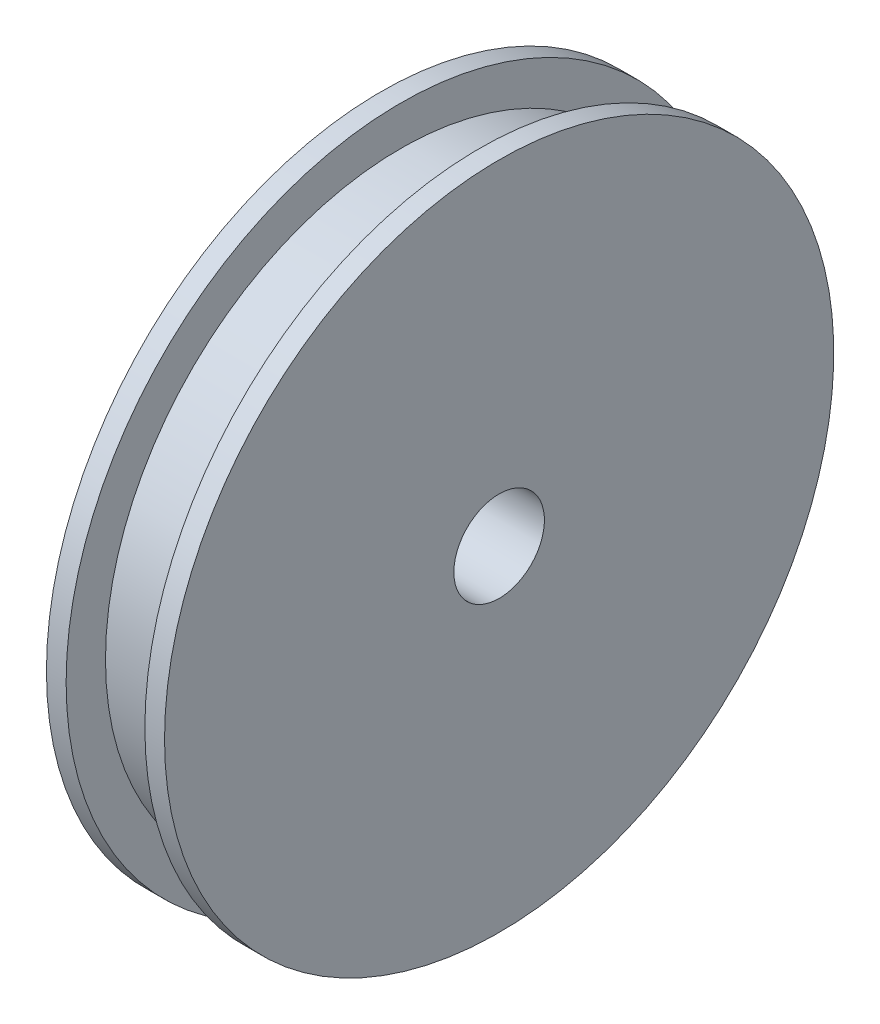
ISO-10303-21;
HEADER;
FILE_DESCRIPTION(('STEP AP214'),'2;1');
FILE_NAME('part.step','',(''),(''),'','','');
FILE_SCHEMA(('AUTOMOTIVE_DESIGN { 1 0 10303 214 1 1 1 1 }'));
ENDSEC;
DATA;
#1=APPLICATION_CONTEXT('core data for automotive mechanical design processes');
#2=APPLICATION_PROTOCOL_DEFINITION('international standard','automotive_design',2000,#1);
#3=PRODUCT_CONTEXT('',#1,'mechanical');
#4=PRODUCT('Part','Part','',(#3));
#5=PRODUCT_RELATED_PRODUCT_CATEGORY('part','',(#4));
#6=PRODUCT_DEFINITION_FORMATION('','',#4);
#7=PRODUCT_DEFINITION_CONTEXT('part definition',#1,'design');
#8=PRODUCT_DEFINITION('design','',#6,#7);
#9=PRODUCT_DEFINITION_SHAPE('','',#8);
#10=(LENGTH_UNIT() NAMED_UNIT(*) SI_UNIT(.MILLI.,.METRE.));
#11=(NAMED_UNIT(*) PLANE_ANGLE_UNIT() SI_UNIT($,.RADIAN.));
#12=(NAMED_UNIT(*) SI_UNIT($,.STERADIAN.) SOLID_ANGLE_UNIT());
#13=UNCERTAINTY_MEASURE_WITH_UNIT(LENGTH_MEASURE(1.E-05),#10,'distance_accuracy_value','');
#14=(GEOMETRIC_REPRESENTATION_CONTEXT(3) GLOBAL_UNCERTAINTY_ASSIGNED_CONTEXT((#13)) GLOBAL_UNIT_ASSIGNED_CONTEXT((#10,
#11,#12)) REPRESENTATION_CONTEXT('',''));
#15=CARTESIAN_POINT('',(0.,0.,0.));
#16=DIRECTION('',(0.,0.,1.));
#17=DIRECTION('',(1.,0.,0.));
#18=AXIS2_PLACEMENT_3D('',#15,#16,#17);
#19=CARTESIAN_POINT('',(3.,0.,0.));
#20=DIRECTION('',(-1.,0.,0.));
#21=DIRECTION('',(0.,0.,1.));
#22=AXIS2_PLACEMENT_3D('',#19,#20,#21);
#23=CYLINDRICAL_SURFACE('',#22,2.3);
#24=CARTESIAN_POINT('',(3.,0.,0.));
#25=DIRECTION('',(-1.,0.,0.));
#26=DIRECTION('',(0.,0.,1.));
#27=AXIS2_PLACEMENT_3D('',#24,#25,#26);
#28=CIRCLE('',#27,2.3);
#29=CARTESIAN_POINT('',(3.,0.,2.3));
#30=VERTEX_POINT('',#29);
#31=EDGE_CURVE('E74',#30,#30,#28,.T.);
#32=ORIENTED_EDGE('',*,*,#31,.F.);
#33=EDGE_LOOP('',(#32));
#34=FACE_BOUND('',#33,.T.);
#35=CARTESIAN_POINT('',(-2.,0.,0.));
#36=DIRECTION('',(-1.,0.,0.));
#37=DIRECTION('',(0.,0.,1.));
#38=AXIS2_PLACEMENT_3D('',#35,#36,#37);
#39=CIRCLE('',#38,2.3);
#40=CARTESIAN_POINT('',(-2.,0.,2.3));
#41=VERTEX_POINT('',#40);
#42=EDGE_CURVE('E44',#41,#41,#39,.F.);
#43=ORIENTED_EDGE('',*,*,#42,.F.);
#44=EDGE_LOOP('',(#43));
#45=FACE_BOUND('',#44,.T.);
#46=ADVANCED_FACE('F33',(#34,#45),#23,.F.);
#47=CARTESIAN_POINT('',(-3.,0.,0.));
#48=DIRECTION('',(1.,0.,0.));
#49=DIRECTION('',(0.,0.,-1.));
#50=AXIS2_PLACEMENT_3D('',#47,#48,#49);
#51=PLANE('',#50);
#52=CARTESIAN_POINT('',(-3.,0.,0.));
#53=DIRECTION('',(-1.,0.,0.));
#54=DIRECTION('',(0.,0.,1.));
#55=AXIS2_PLACEMENT_3D('',#52,#53,#54);
#56=CIRCLE('',#55,17.);
#57=CARTESIAN_POINT('',(-3.,0.,17.));
#58=VERTEX_POINT('',#57);
#59=EDGE_CURVE('E60',#58,#58,#56,.T.);
#60=ORIENTED_EDGE('',*,*,#59,.T.);
#61=EDGE_LOOP('',(#60));
#62=FACE_BOUND('',#61,.T.);
#63=CARTESIAN_POINT('',(-3.,0.,0.));
#64=DIRECTION('',(1.,0.,0.));
#65=DIRECTION('',(0.,0.,-1.));
#66=AXIS2_PLACEMENT_3D('',#63,#64,#65);
#67=CIRCLE('',#66,4.);
#68=CARTESIAN_POINT('',(-3.,0.,-4.));
#69=VERTEX_POINT('',#68);
#70=EDGE_CURVE('E48',#69,#69,#67,.F.);
#71=ORIENTED_EDGE('',*,*,#70,.F.);
#72=EDGE_LOOP('',(#71));
#73=FACE_BOUND('',#72,.T.);
#74=ADVANCED_FACE('F114',(#62,#73),#51,.F.);
#75=CARTESIAN_POINT('',(3.,0.,0.));
#76=DIRECTION('',(-1.,0.,0.));
#77=DIRECTION('',(0.,0.,1.));
#78=AXIS2_PLACEMENT_3D('',#75,#76,#77);
#79=CYLINDRICAL_SURFACE('',#78,15.);
#80=CARTESIAN_POINT('',(-2.,0.,0.));
#81=DIRECTION('',(-1.,0.,0.));
#82=DIRECTION('',(0.,0.,1.));
#83=AXIS2_PLACEMENT_3D('',#80,#81,#82);
#84=CIRCLE('',#83,15.);
#85=CARTESIAN_POINT('',(-2.,0.,15.));
#86=VERTEX_POINT('',#85);
#87=EDGE_CURVE('E56',#86,#86,#84,.T.);
#88=ORIENTED_EDGE('',*,*,#87,.F.);
#89=EDGE_LOOP('',(#88));
#90=FACE_BOUND('',#89,.T.);
#91=CARTESIAN_POINT('',(2.,0.,0.));
#92=DIRECTION('',(1.,0.,0.));
#93=DIRECTION('',(0.,0.,-1.));
#94=AXIS2_PLACEMENT_3D('',#91,#92,#93);
#95=CIRCLE('',#94,15.);
#96=CARTESIAN_POINT('',(2.,0.,-15.));
#97=VERTEX_POINT('',#96);
#98=EDGE_CURVE('E53',#97,#97,#95,.T.);
#99=ORIENTED_EDGE('',*,*,#98,.F.);
#100=EDGE_LOOP('',(#99));
#101=FACE_BOUND('',#100,.T.);
#102=ADVANCED_FACE('F120',(#90,#101),#79,.T.);
#103=CARTESIAN_POINT('',(-2.,0.,0.));
#104=DIRECTION('',(-1.,0.,0.));
#105=DIRECTION('',(0.,0.,1.));
#106=AXIS2_PLACEMENT_3D('',#103,#104,#105);
#107=PLANE('',#106);
#108=CARTESIAN_POINT('',(-2.,0.,0.));
#109=DIRECTION('',(-1.,0.,0.));
#110=DIRECTION('',(0.,0.,1.));
#111=AXIS2_PLACEMENT_3D('',#108,#109,#110);
#112=CIRCLE('',#111,17.);
#113=CARTESIAN_POINT('',(-2.,0.,17.));
#114=VERTEX_POINT('',#113);
#115=EDGE_CURVE('E59',#114,#114,#112,.T.);
#116=ORIENTED_EDGE('',*,*,#115,.F.);
#117=EDGE_LOOP('',(#116));
#118=FACE_BOUND('',#117,.T.);
#119=ORIENTED_EDGE('',*,*,#87,.T.);
#120=EDGE_LOOP('',(#119));
#121=FACE_BOUND('',#120,.T.);
#122=ADVANCED_FACE('F147',(#118,#121),#107,.F.);
#123=CARTESIAN_POINT('',(-2.,0.,0.));
#124=DIRECTION('',(-1.,0.,0.));
#125=DIRECTION('',(0.,0.,1.));
#126=AXIS2_PLACEMENT_3D('',#123,#124,#125);
#127=CYLINDRICAL_SURFACE('',#126,17.);
#128=ORIENTED_EDGE('',*,*,#115,.T.);
#129=EDGE_LOOP('',(#128));
#130=FACE_BOUND('',#129,.T.);
#131=ORIENTED_EDGE('',*,*,#59,.F.);
#132=EDGE_LOOP('',(#131));
#133=FACE_BOUND('',#132,.T.);
#134=ADVANCED_FACE('F141',(#130,#133),#127,.T.);
#135=CARTESIAN_POINT('',(2.,0.,0.));
#136=DIRECTION('',(1.,0.,0.));
#137=DIRECTION('',(0.,0.,1.));
#138=AXIS2_PLACEMENT_3D('',#135,#136,#137);
#139=PLANE('',#138);
#140=CARTESIAN_POINT('',(2.,0.,0.));
#141=DIRECTION('',(-1.,0.,0.));
#142=DIRECTION('',(0.,0.,1.));
#143=AXIS2_PLACEMENT_3D('',#140,#141,#142);
#144=CIRCLE('',#143,17.);
#145=CARTESIAN_POINT('',(2.,0.,17.));
#146=VERTEX_POINT('',#145);
#147=EDGE_CURVE('E63',#146,#146,#144,.T.);
#148=ORIENTED_EDGE('',*,*,#147,.T.);
#149=EDGE_LOOP('',(#148));
#150=FACE_BOUND('',#149,.T.);
#151=ORIENTED_EDGE('',*,*,#98,.T.);
#152=EDGE_LOOP('',(#151));
#153=FACE_BOUND('',#152,.T.);
#154=ADVANCED_FACE('F135',(#150,#153),#139,.F.);
#155=CARTESIAN_POINT('',(2.,0.,0.));
#156=DIRECTION('',(1.,0.,0.));
#157=DIRECTION('',(0.,0.,-1.));
#158=AXIS2_PLACEMENT_3D('',#155,#156,#157);
#159=CYLINDRICAL_SURFACE('',#158,17.);
#160=ORIENTED_EDGE('',*,*,#147,.F.);
#161=EDGE_LOOP('',(#160));
#162=FACE_BOUND('',#161,.T.);
#163=CARTESIAN_POINT('',(3.,0.,0.));
#164=DIRECTION('',(-1.,0.,0.));
#165=DIRECTION('',(0.,0.,1.));
#166=AXIS2_PLACEMENT_3D('',#163,#164,#165);
#167=CIRCLE('',#166,17.);
#168=CARTESIAN_POINT('',(3.,0.,17.));
#169=VERTEX_POINT('',#168);
#170=EDGE_CURVE('E66',#169,#169,#167,.T.);
#171=ORIENTED_EDGE('',*,*,#170,.T.);
#172=EDGE_LOOP('',(#171));
#173=FACE_BOUND('',#172,.T.);
#174=ADVANCED_FACE('F130',(#162,#173),#159,.T.);
#175=CARTESIAN_POINT('',(3.,0.,0.));
#176=DIRECTION('',(1.,0.,0.));
#177=DIRECTION('',(0.,0.,-1.));
#178=AXIS2_PLACEMENT_3D('',#175,#176,#177);
#179=PLANE('',#178);
#180=ORIENTED_EDGE('',*,*,#31,.T.);
#181=EDGE_LOOP('',(#180));
#182=FACE_BOUND('',#181,.T.);
#183=ORIENTED_EDGE('',*,*,#170,.F.);
#184=EDGE_LOOP('',(#183));
#185=FACE_BOUND('',#184,.T.);
#186=ADVANCED_FACE('F127',(#182,#185),#179,.T.);
#187=CARTESIAN_POINT('',(-6.,0.,0.));
#188=DIRECTION('',(1.,0.,0.));
#189=DIRECTION('',(0.,0.,-1.));
#190=AXIS2_PLACEMENT_3D('',#187,#188,#189);
#191=CYLINDRICAL_SURFACE('',#190,4.);
#192=CARTESIAN_POINT('',(-6.,0.,0.));
#193=DIRECTION('',(-1.,0.,0.));
#194=DIRECTION('',(0.,0.,1.));
#195=AXIS2_PLACEMENT_3D('',#192,#193,#194);
#196=CIRCLE('',#195,4.);
#197=CARTESIAN_POINT('',(-6.,0.,4.));
#198=VERTEX_POINT('',#197);
#199=EDGE_CURVE('E69',#198,#198,#196,.T.);
#200=ORIENTED_EDGE('',*,*,#199,.F.);
#201=EDGE_LOOP('',(#200));
#202=FACE_BOUND('',#201,.T.);
#203=ORIENTED_EDGE('',*,*,#70,.T.);
#204=EDGE_LOOP('',(#203));
#205=FACE_BOUND('',#204,.T.);
#206=ADVANCED_FACE('F111',(#202,#205),#191,.T.);
#207=CARTESIAN_POINT('',(-6.,0.,0.));
#208=DIRECTION('',(-1.,0.,0.));
#209=DIRECTION('',(0.,0.,1.));
#210=AXIS2_PLACEMENT_3D('',#207,#208,#209);
#211=PLANE('',#210);
#212=CARTESIAN_POINT('',(-6.,0.,0.));
#213=DIRECTION('',(-1.,0.,0.));
#214=DIRECTION('',(0.,0.,1.));
#215=AXIS2_PLACEMENT_3D('',#212,#213,#214);
#216=CIRCLE('',#215,2.8);
#217=CARTESIAN_POINT('',(-6.,0.,2.8));
#218=VERTEX_POINT('',#217);
#219=EDGE_CURVE('E10',#218,#218,#216,.F.);
#220=ORIENTED_EDGE('',*,*,#219,.T.);
#221=EDGE_LOOP('',(#220));
#222=FACE_BOUND('',#221,.T.);
#223=ORIENTED_EDGE('',*,*,#199,.T.);
#224=EDGE_LOOP('',(#223));
#225=FACE_BOUND('',#224,.T.);
#226=ADVANCED_FACE('F104',(#222,#225),#211,.T.);
#227=CARTESIAN_POINT('',(-5.50000000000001,0.,0.));
#228=DIRECTION('',(-1.,0.,0.));
#229=DIRECTION('',(0.,0.,1.));
#230=AXIS2_PLACEMENT_3D('',#227,#228,#229);
#231=CIRCLE('',#230,2.3);
#232=CARTESIAN_POINT('',(-5.50000000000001,0.,2.3));
#233=VERTEX_POINT('',#232);
#234=EDGE_CURVE('E40',#233,#233,#231,.T.);
#235=ORIENTED_EDGE('',*,*,#234,.T.);
#236=EDGE_LOOP('',(#235));
#237=FACE_BOUND('',#236,.T.);
#238=CARTESIAN_POINT('',(-3.,0.,0.));
#239=DIRECTION('',(-1.,0.,0.));
#240=DIRECTION('',(0.,0.,1.));
#241=AXIS2_PLACEMENT_3D('',#238,#239,#240);
#242=CIRCLE('',#241,2.3);
#243=CARTESIAN_POINT('',(-3.,0.,2.3));
#244=VERTEX_POINT('',#243);
#245=EDGE_CURVE('E77',#244,#244,#242,.T.);
#246=ORIENTED_EDGE('',*,*,#245,.F.);
#247=EDGE_LOOP('',(#246));
#248=FACE_BOUND('',#247,.T.);
#249=ADVANCED_FACE('F102',(#237,#248),#23,.F.);
#250=CARTESIAN_POINT('',(-2.,0.,0.));
#251=DIRECTION('',(-1.,0.,0.));
#252=DIRECTION('',(0.,0.,1.));
#253=AXIS2_PLACEMENT_3D('',#250,#251,#252);
#254=PLANE('',#253);
#255=CARTESIAN_POINT('',(-2.,0.,0.));
#256=DIRECTION('',(-1.,0.,0.));
#257=DIRECTION('',(0.,0.,1.));
#258=AXIS2_PLACEMENT_3D('',#255,#256,#257);
#259=CIRCLE('',#258,1.5);
#260=CARTESIAN_POINT('',(-2.,0.,1.5));
#261=VERTEX_POINT('',#260);
#262=EDGE_CURVE('E80',#261,#261,#259,.T.);
#263=ORIENTED_EDGE('',*,*,#262,.T.);
#264=EDGE_LOOP('',(#263));
#265=FACE_BOUND('',#264,.T.);
#266=ORIENTED_EDGE('',*,*,#42,.T.);
#267=EDGE_LOOP('',(#266));
#268=FACE_BOUND('',#267,.T.);
#269=ADVANCED_FACE('F87',(#265,#268),#254,.F.);
#270=CARTESIAN_POINT('',(-3.,0.,0.));
#271=DIRECTION('',(-1.,0.,0.));
#272=DIRECTION('',(0.,0.,1.));
#273=AXIS2_PLACEMENT_3D('',#270,#271,#272);
#274=PLANE('',#273);
#275=CARTESIAN_POINT('',(-3.,0.,0.));
#276=DIRECTION('',(-1.,0.,0.));
#277=DIRECTION('',(0.,0.,1.));
#278=AXIS2_PLACEMENT_3D('',#275,#276,#277);
#279=CIRCLE('',#278,1.5);
#280=CARTESIAN_POINT('',(-3.,0.,1.5));
#281=VERTEX_POINT('',#280);
#282=EDGE_CURVE('E81',#281,#281,#279,.T.);
#283=ORIENTED_EDGE('',*,*,#282,.F.);
#284=EDGE_LOOP('',(#283));
#285=FACE_BOUND('',#284,.T.);
#286=ORIENTED_EDGE('',*,*,#245,.T.);
#287=EDGE_LOOP('',(#286));
#288=FACE_BOUND('',#287,.T.);
#289=ADVANCED_FACE('F93',(#285,#288),#274,.T.);
#290=CARTESIAN_POINT('',(-2.,0.,0.));
#291=DIRECTION('',(-1.,0.,0.));
#292=DIRECTION('',(0.,0.,1.));
#293=AXIS2_PLACEMENT_3D('',#290,#291,#292);
#294=CYLINDRICAL_SURFACE('',#293,1.5);
#295=ORIENTED_EDGE('',*,*,#262,.F.);
#296=EDGE_LOOP('',(#295));
#297=FACE_BOUND('',#296,.T.);
#298=ORIENTED_EDGE('',*,*,#282,.T.);
#299=EDGE_LOOP('',(#298));
#300=FACE_BOUND('',#299,.T.);
#301=ADVANCED_FACE('F90',(#297,#300),#294,.F.);
#302=CARTESIAN_POINT('',(-5.50000000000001,0.,0.));
#303=DIRECTION('',(-1.,0.,0.));
#304=DIRECTION('',(0.,0.,1.));
#305=AXIS2_PLACEMENT_3D('',#302,#303,#304);
#306=CONICAL_SURFACE('',#305,2.3,0.785398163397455);
#307=ORIENTED_EDGE('',*,*,#219,.F.);
#308=EDGE_LOOP('',(#307));
#309=FACE_BOUND('',#308,.T.);
#310=ORIENTED_EDGE('',*,*,#234,.F.);
#311=EDGE_LOOP('',(#310));
#312=FACE_BOUND('',#311,.T.);
#313=ADVANCED_FACE('F35',(#309,#312),#306,.F.);
#314=CLOSED_SHELL('',(#46,#74,#102,#122,#134,#154,#174,#186,#206,#226,#249,#269,#289,#301,#313));
#315=MANIFOLD_SOLID_BREP('B2',#314);
#316=ADVANCED_BREP_SHAPE_REPRESENTATION('',(#18,#315),#14);
#317=SHAPE_DEFINITION_REPRESENTATION(#9,#316);
ENDSEC;
END-ISO-10303-21;
